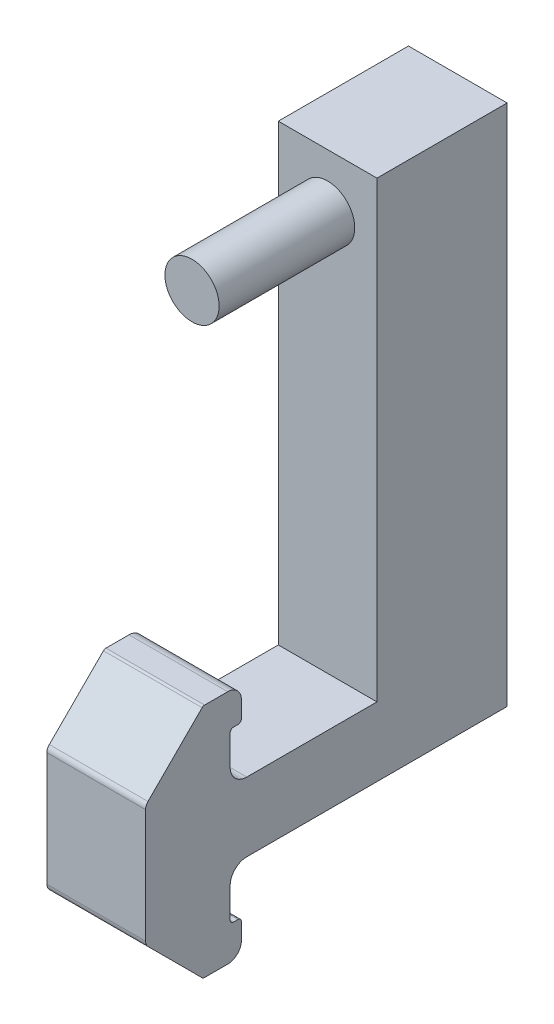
from build123d import *

# Parameters (mm, degrees)
SKETCH1_R           = 2.5
BOSS_EXTRUDE1_DEPTH = 12.5
BOSS_EXTRUDE2_DEPTH = 12
BOSS_EXTRUDE3_START = -9.093242
BOSS_EXTRUDE3_DEPTH = 9.093242


with BuildPart() as part:
    # Sketch1 → Boss-Extrude1 (new body)
    with BuildSketch(Plane.XY):
        Circle(SKETCH1_R)
    extrude(amount=BOSS_EXTRUDE1_DEPTH)

    # Sketch2 → Boss-Extrude2 (add)
    with BuildSketch(Plane(origin=(0, 0, 0), x_dir=(-1, 0, 0), z_dir=(0, 0, -1))):
        Polygon((-4.546621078, 0), (-4.546621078, 5), (4.546621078, 5), (4.546621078, 0), (4.546621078, -40), (-4.546621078, -40), align=None)
    extrude(amount=BOSS_EXTRUDE2_DEPTH)

    # Sketch4 → Boss-Extrude3 (add)
    with BuildSketch(Plane(origin=(4.546621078, 0, 0), x_dir=(0, 0, -1), z_dir=(1, 0, 0)).offset(BOSS_EXTRUDE3_START)):
        with BuildLine():
            Line((-16.11627417, -29.21872583), (-21.108732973, -34.211184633))
            ThreePointArc((-21.108732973, -34.211184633), (-21.273913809, -34.458395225), (-21.331917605, -34.75))
            Line((-21.331917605, -34.75), (-21.331917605, -45.25))
            ThreePointArc((-21.331917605, -45.25), (-21.273913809, -45.541604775), (-21.108732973, -45.788815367))
            Line((-21.108732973, -45.788815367), (-16.11627417, -50.78127417))
            ThreePointArc((-16.11627417, -50.78127417), (-16.012458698, -50.85064145), (-15.89, -50.875))
            Line((-15.89, -50.875), (-13.76, -50.875))
            ThreePointArc((-13.76, -50.875), (-12.861974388, -50.503025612), (-12.49, -49.605))
            Line((-12.49, -49.605), (-12.49, -48.105))
            ThreePointArc((-12.49, -48.105), (-12.58372583, -47.87872583), (-12.81, -47.785))
            Line((-12.81, -47.785), (-13.21, -47.785))
            ThreePointArc((-13.21, -47.785), (-13.43627417, -47.69127417), (-13.53, -47.465))
            Line((-13.53, -47.465), (-13.53, -44.715))
            ThreePointArc((-13.53, -44.715), (-13.081873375, -43.633126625), (-12, -43.185))
            Line((-12, -43.185), (0, -43.185))
            Line((0, -43.185), (12, -43.185))
            Line((12, -43.185), (12, -40))
            Line((12, -40), (0, -40))
            Line((0, -40), (0, -36.815))
            Line((0, -36.815), (-12, -36.815))
            ThreePointArc((-12, -36.815), (-13.081873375, -36.366873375), (-13.53, -35.285))
            Line((-13.53, -35.285), (-13.53, -32.535))
            ThreePointArc((-13.53, -32.535), (-13.43627417, -32.30872583), (-13.21, -32.215))
            Line((-13.21, -32.215), (-12.81, -32.215))
            ThreePointArc((-12.81, -32.215), (-12.58372583, -32.12127417), (-12.49, -31.895))
            Line((-12.49, -31.895), (-12.49, -30.395))
            ThreePointArc((-12.49, -30.395), (-12.861974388, -29.496974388), (-13.76, -29.125))
            Line((-13.76, -29.125), (-15.89, -29.125))
            ThreePointArc((-15.89, -29.125), (-16.012458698, -29.14935855), (-16.11627417, -29.21872583))
        make_face()
    extrude(amount=BOSS_EXTRUDE3_DEPTH)


solid = part.part
